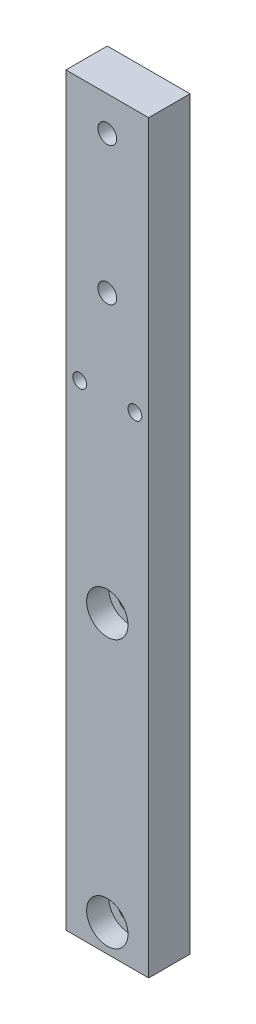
from build123d import *

# Parameters (mm, degrees)
ESQUISSE1_W                             = 30
ESQUISSE1_H                             = 15
EXTRUSION1_DEPTH                        = 270
CHAMBRAGE_POUR_AXES_8_5_MM1_D           = 8.5
CHAMBRAGE_POUR_AXES_8_5_MM1_CBORE_D     = 15
CHAMBRAGE_POUR_AXES_8_5_MM1_CBORE_DEPTH = 8
TROU_TARAUD_M81_D                       = 6.8
TROU_TARAUD_M61_D                       = 5


with BuildPart() as part:
    # Esquisse1 → Extrusion1 (new body)
    with BuildSketch(Plane(origin=(0, 0, 0), x_dir=(1, 0, 0), z_dir=(0, 1, 0))):
        with Locations((0, 7.5)):
            Rectangle(ESQUISSE1_W, ESQUISSE1_H)
    extrude(amount=EXTRUSION1_DEPTH)

    # Chambrage pour axes 8.5 mm1 (through all)
    with Locations(Plane.XY):
        with Locations((0, 107), (0, 10)):
            CounterBoreHole(CHAMBRAGE_POUR_AXES_8_5_MM1_D / 2, CHAMBRAGE_POUR_AXES_8_5_MM1_CBORE_D / 2, CHAMBRAGE_POUR_AXES_8_5_MM1_CBORE_DEPTH)

    # Trou taraud_ M81 (through all)
    with Locations(Plane.XY):
        with Locations((0, 257.5), (0, 207.5)):
            Hole(TROU_TARAUD_M81_D / 2)

    # Trou taraud_ M61 (through all)
    with Locations(Plane.XY):
        with Locations((-10, 175), (10, 175)):
            Hole(TROU_TARAUD_M61_D / 2)


solid = part.part
